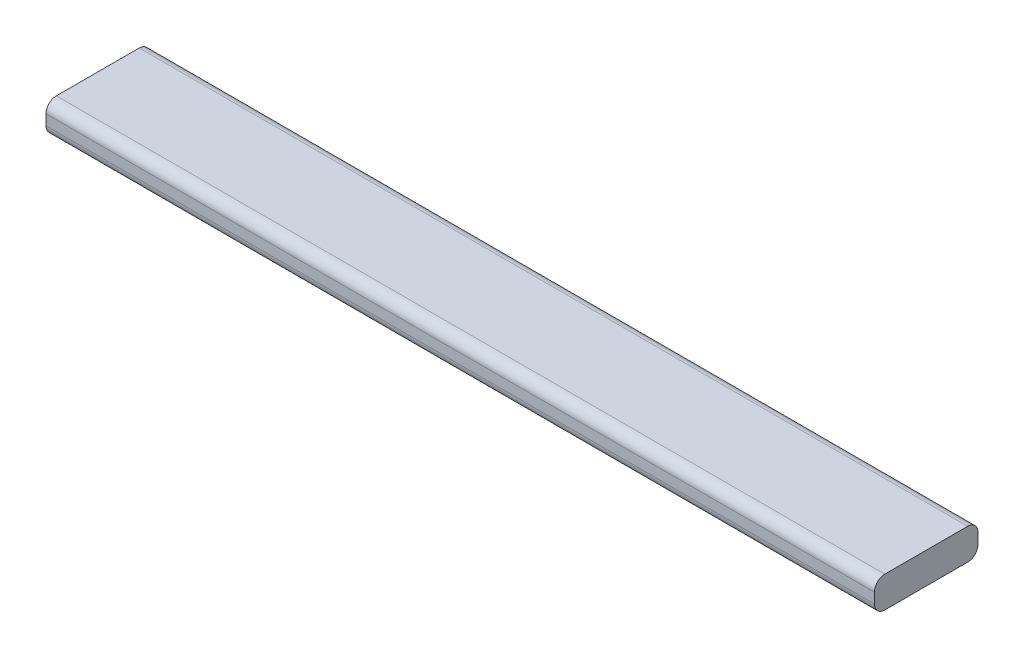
from build123d import *

# Parameters (mm, degrees)
SKETCH2_W           = 63.5
SKETCH2_H           = 19.05
BOSS_EXTRUDE1_DEPTH = 508
FILLET1_R           = 6.35


with BuildPart() as part:
    # Sketch2 → Boss-Extrude1 (new body)
    with BuildSketch(Plane(origin=(0, 0, 0), x_dir=(0, 0, -1), z_dir=(1, 0, 0))):
        with Locations((-31.75, 9.525)):
            Rectangle(SKETCH2_W, SKETCH2_H)
    extrude(amount=BOSS_EXTRUDE1_DEPTH)

    # Fillet1
    fillet1_edges = [part.edges().sort_by_distance(p)[0] for p in [
        (254, 19.05, 63.5),
        (254, 0, 63.5),
        (254, 0, 0),
        (254, 19.05, 0),
    ]]
    fillet(fillet1_edges, radius=FILLET1_R)


solid = part.part
